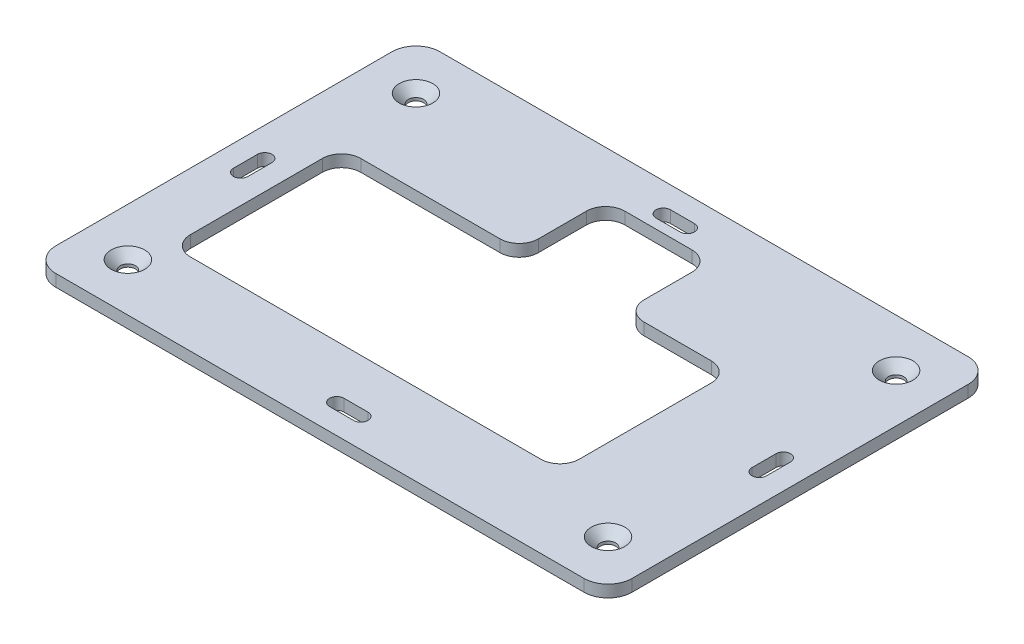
from build123d import *

# Parameters (mm, degrees)
CROQUIS1_W              = 120
CROQUIS1_H              = 80
SALIENTE_EXTRUIR1_DEPTH = 2.5
REDONDEO1_R             = 5
CROQUIS2_W              = 81
CROQUIS2_H              = 35.5
CORTAR_EXTRUIR1_DEPTH   = 73.154348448
CROQUIS3_R              = 1.6
CORTAR_EXTRUIR2_DEPTH   = 73.154348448
CHAFL_N1_SIZE           = 1.9
CROQUIS4_W              = 22
CROQUIS4_H              = 27.540708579
CORTAR_EXTRUIR3_DEPTH   = 73.154348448
REDONDEO4_R             = 4
CORTAR_EXTRUIR4_DEPTH   = 10


with BuildPart() as part:
    # Croquis1 → Saliente-Extruir1 (new body)
    with BuildSketch(Plane(origin=(0, 0, 0), x_dir=(1, 0, 0), z_dir=(0, 1, 0))):
        Rectangle(CROQUIS1_W, CROQUIS1_H)
    extrude(amount=SALIENTE_EXTRUIR1_DEPTH)

    # Redondeo1
    redondeo1_edges = [part.edges().sort_by_distance(p)[0] for p in [
        (60, 1.25, 40),
        (-60, 1.25, 40),
        (-60, 1.25, -40),
        (60, 1.25, -40),
    ]]
    fillet(redondeo1_edges, radius=REDONDEO1_R)

    # Croquis2 → Cortar-Extruir1 (cut, through all)
    with BuildSketch(Plane(origin=(0, 2.5, 0), x_dir=(1, 0, 0), z_dir=(0, 1, 0))):
        with Locations((-7.5, -5.25)):
            Rectangle(CROQUIS2_W, CROQUIS2_H)
    extrude(amount=-CORTAR_EXTRUIR1_DEPTH, mode=Mode.SUBTRACT)

    # Croquis3 → Cortar-Extruir2 (cut, through all)
    with BuildSketch(Plane(origin=(0, 2.5, 0), x_dir=(1, 0, 0), z_dir=(0, 1, 0))):
        with Locations(Location((-50, 30, 0), (0, 0, 270))):
            Circle(CROQUIS3_R)
        with Locations(Location((50, 30, 0), (0, 0, 270))):
            Circle(CROQUIS3_R)
        with Locations(Location((50, -30, 0), (0, 0, 270))):
            Circle(CROQUIS3_R)
        with Locations(Location((-50, -30, 0), (0, 0, 270))):
            Circle(CROQUIS3_R)
    extrude(amount=-CORTAR_EXTRUIR2_DEPTH, mode=Mode.SUBTRACT)

    # Chafl_n1
    chafl_n1_edges = [part.edges().sort_by_distance(p)[0] for p in [
        (-50, 2.5, 28.4),
        (50, 2.5, 28.4),
        (50, 2.5, -31.6),
        (-50, 2.5, -31.6),
    ]]
    chamfer(chafl_n1_edges, length=CHAFL_N1_SIZE)

    # Croquis4 → Cortar-Extruir3 (cut, through all)
    with BuildSketch(Plane.XZ):
        with Locations((0, -16.729645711)):
            Rectangle(CROQUIS4_W, CROQUIS4_H)
    extrude(amount=-CORTAR_EXTRUIR3_DEPTH, mode=Mode.SUBTRACT)

    # Redondeo4
    redondeo4_edges = [part.edges().sort_by_distance(p)[0] for p in [
        (33, 1.25, -12.5),
        (33, 1.25, 23),
        (-48, 1.25, 23),
        (-48, 1.25, -12.5),
        (11, 1.25, -12.5),
        (-11, 1.25, -12.5),
        (-11, 1.25, -30.5),
        (11, 1.25, -30.5),
    ]]
    fillet(redondeo4_edges, radius=REDONDEO4_R)

    # Croquis5 → Cortar-Extruir4 (cut)
    with BuildSketch(Plane.XZ):
        with BuildLine():
            Line((-2.5, 35.5), (2.5, 35.5))
            ThreePointArc((2.5, 35.5), (4, 34), (2.5, 32.5))
            Line((2.5, 32.5), (-2.5, 32.5))
            ThreePointArc((-2.5, 32.5), (-4, 34), (-2.5, 35.5))
        make_face()
        with BuildLine():
            Line((-2.5, -32.5), (2.5, -32.5))
            ThreePointArc((2.5, -32.5), (4, -34), (2.5, -35.5))
            Line((2.5, -35.5), (-2.5, -35.5))
            ThreePointArc((-2.5, -35.5), (-4, -34), (-2.5, -32.5))
        make_face()
        with BuildLine():
            Line((52.5, 2.5), (52.5, -2.5))
            ThreePointArc((52.5, -2.5), (54, -4), (55.5, -2.5))
            Line((55.5, -2.5), (55.5, 2.5))
            ThreePointArc((55.5, 2.5), (54, 4), (52.5, 2.5))
        make_face()
        with BuildLine():
            Line((-55.5, 2.5), (-55.5, -2.5))
            ThreePointArc((-55.5, -2.5), (-54, -4), (-52.5, -2.5))
            Line((-52.5, -2.5), (-52.5, 2.5))
            ThreePointArc((-52.5, 2.5), (-54, 4), (-55.5, 2.5))
        make_face()
    extrude(amount=-CORTAR_EXTRUIR4_DEPTH, mode=Mode.SUBTRACT)


solid = part.part
